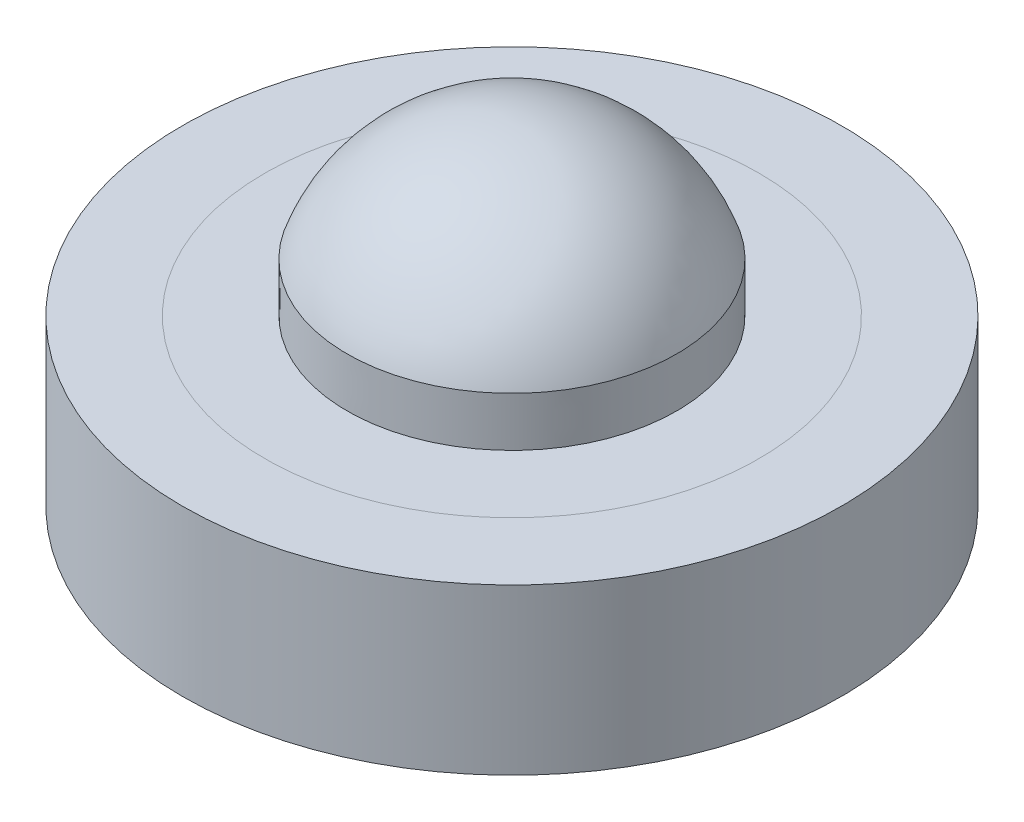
ISO-10303-21;
HEADER;
FILE_DESCRIPTION(('STEP AP214'),'2;1');
FILE_NAME('part.step','',(''),(''),'','','');
FILE_SCHEMA(('AUTOMOTIVE_DESIGN { 1 0 10303 214 1 1 1 1 }'));
ENDSEC;
DATA;
#1=APPLICATION_CONTEXT('core data for automotive mechanical design processes');
#2=APPLICATION_PROTOCOL_DEFINITION('international standard','automotive_design',2000,#1);
#3=PRODUCT_CONTEXT('',#1,'mechanical');
#4=PRODUCT('Part','Part','',(#3));
#5=PRODUCT_RELATED_PRODUCT_CATEGORY('part','',(#4));
#6=PRODUCT_DEFINITION_FORMATION('','',#4);
#7=PRODUCT_DEFINITION_CONTEXT('part definition',#1,'design');
#8=PRODUCT_DEFINITION('design','',#6,#7);
#9=PRODUCT_DEFINITION_SHAPE('','',#8);
#10=(LENGTH_UNIT() NAMED_UNIT(*) SI_UNIT(.MILLI.,.METRE.));
#11=(NAMED_UNIT(*) PLANE_ANGLE_UNIT() SI_UNIT($,.RADIAN.));
#12=(NAMED_UNIT(*) SI_UNIT($,.STERADIAN.) SOLID_ANGLE_UNIT());
#13=UNCERTAINTY_MEASURE_WITH_UNIT(LENGTH_MEASURE(1.E-05),#10,'distance_accuracy_value','');
#14=(GEOMETRIC_REPRESENTATION_CONTEXT(3) GLOBAL_UNCERTAINTY_ASSIGNED_CONTEXT((#13)) GLOBAL_UNIT_ASSIGNED_CONTEXT((#10,
#11,#12)) REPRESENTATION_CONTEXT('',''));
#15=CARTESIAN_POINT('',(0.,0.,0.));
#16=DIRECTION('',(0.,0.,1.));
#17=DIRECTION('',(1.,0.,0.));
#18=AXIS2_PLACEMENT_3D('',#15,#16,#17);
#19=CARTESIAN_POINT('',(4.8278025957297,-44.4320712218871,0.));
#20=DIRECTION('',(0.,1.,0.));
#21=DIRECTION('',(0.,0.,1.));
#22=AXIS2_PLACEMENT_3D('',#19,#20,#21);
#23=PLANE('',#22);
#24=CARTESIAN_POINT('',(4.8278025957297,-44.4320712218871,0.));
#25=DIRECTION('',(0.,1.,0.));
#26=DIRECTION('',(0.,0.,1.));
#27=AXIS2_PLACEMENT_3D('',#24,#25,#26);
#28=CIRCLE('',#27,20.);
#29=CARTESIAN_POINT('',(4.8278025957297,-44.4320712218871,20.));
#30=VERTEX_POINT('',#29);
#31=EDGE_CURVE('E105',#30,#30,#28,.T.);
#32=ORIENTED_EDGE('',*,*,#31,.F.);
#33=EDGE_LOOP('',(#32));
#34=FACE_BOUND('',#33,.T.);
#35=ADVANCED_FACE('F68',(#34),#23,.F.);
#36=CARTESIAN_POINT('',(4.8278025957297,-44.4320712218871,0.));
#37=DIRECTION('',(0.,1.,0.));
#38=DIRECTION('',(0.,0.,1.));
#39=AXIS2_PLACEMENT_3D('',#36,#37,#38);
#40=CYLINDRICAL_SURFACE('',#39,20.);
#41=ORIENTED_EDGE('',*,*,#31,.T.);
#42=EDGE_LOOP('',(#41));
#43=FACE_BOUND('',#42,.T.);
#44=CARTESIAN_POINT('',(4.8278025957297,-34.4320712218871,0.));
#45=DIRECTION('',(0.,1.,0.));
#46=DIRECTION('',(0.,0.,1.));
#47=AXIS2_PLACEMENT_3D('',#44,#45,#46);
#48=CIRCLE('',#47,20.);
#49=CARTESIAN_POINT('',(4.8278025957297,-34.4320712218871,20.));
#50=VERTEX_POINT('',#49);
#51=EDGE_CURVE('E72',#50,#50,#48,.F.);
#52=ORIENTED_EDGE('',*,*,#51,.T.);
#53=EDGE_LOOP('',(#52));
#54=FACE_BOUND('',#53,.T.);
#55=ADVANCED_FACE('F70',(#43,#54),#40,.T.);
#56=CARTESIAN_POINT('',(4.8278025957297,-34.8820712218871,0.));
#57=DIRECTION('',(0.,-1.,0.));
#58=DIRECTION('',(-1.,0.,0.));
#59=AXIS2_PLACEMENT_3D('',#56,#57,#58);
#60=SPHERICAL_SURFACE('',#59,10.58);
#61=CARTESIAN_POINT('',(4.8278025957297,-31.4320712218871,0.));
#62=DIRECTION('',(0.,-1.,0.));
#63=DIRECTION('',(0.,0.,-1.));
#64=AXIS2_PLACEMENT_3D('',#61,#62,#63);
#65=CIRCLE('',#64,10.0016948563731);
#66=CARTESIAN_POINT('',(4.8278025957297,-31.4320712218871,-10.0016948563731));
#67=VERTEX_POINT('',#66);
#68=EDGE_CURVE('E107',#67,#67,#65,.T.);
#69=ORIENTED_EDGE('',*,*,#68,.F.);
#70=EDGE_LOOP('',(#69));
#71=FACE_BOUND('',#70,.T.);
#72=ADVANCED_FACE('F101',(#71),#60,.T.);
#73=CARTESIAN_POINT('',(4.8278025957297,-31.4320712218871,0.));
#74=DIRECTION('',(0.,1.,0.));
#75=DIRECTION('',(0.,0.,1.));
#76=AXIS2_PLACEMENT_3D('',#73,#74,#75);
#77=CONICAL_SURFACE('',#76,10.0016948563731,0.000564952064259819);
#78=CARTESIAN_POINT('',(4.8278025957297,-34.4320712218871,0.));
#79=DIRECTION('',(0.,-1.,0.));
#80=DIRECTION('',(0.,0.,-1.));
#81=AXIS2_PLACEMENT_3D('',#78,#79,#80);
#82=CIRCLE('',#81,10.);
#83=CARTESIAN_POINT('',(4.8278025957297,-34.4320712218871,-10.));
#84=VERTEX_POINT('',#83);
#85=EDGE_CURVE('E77',#84,#84,#82,.T.);
#86=ORIENTED_EDGE('',*,*,#85,.F.);
#87=EDGE_LOOP('',(#86));
#88=FACE_BOUND('',#87,.T.);
#89=ORIENTED_EDGE('',*,*,#68,.T.);
#90=EDGE_LOOP('',(#89));
#91=FACE_BOUND('',#90,.T.);
#92=ADVANCED_FACE('F92',(#88,#91),#77,.T.);
#93=CARTESIAN_POINT('',(14.8278025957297,-34.4320712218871,0.));
#94=DIRECTION('',(0.,-1.,0.));
#95=DIRECTION('',(0.,0.,-1.));
#96=AXIS2_PLACEMENT_3D('',#93,#94,#95);
#97=PLANE('',#96);
#98=CARTESIAN_POINT('',(4.8278025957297,-34.4320712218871,-15.));
#99=CARTESIAN_POINT('',(5.07532465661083,-34.4320712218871,-15.0000190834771));
#100=CARTESIAN_POINT('',(5.32285951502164,-34.4320712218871,-14.9941059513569));
#101=CARTESIAN_POINT('',(5.81556402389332,-34.4320712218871,-14.9702985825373));
#102=CARTESIAN_POINT('',(6.06073787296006,-34.4320712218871,-14.9524909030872));
#103=CARTESIAN_POINT('',(6.54872354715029,-34.4320712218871,-14.9048990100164));
#104=CARTESIAN_POINT('',(6.79154106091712,-34.4320712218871,-14.8751733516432));
#105=CARTESIAN_POINT('',(7.27481111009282,-34.4320712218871,-14.8037804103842));
#106=CARTESIAN_POINT('',(7.51526796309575,-34.4320712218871,-14.7621423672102));
#107=CARTESIAN_POINT('',(7.99381910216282,-34.4320712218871,-14.6669527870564));
#108=CARTESIAN_POINT('',(8.23191332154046,-34.4320712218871,-14.6134009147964));
#109=CARTESIAN_POINT('',(8.70574394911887,-34.4320712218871,-14.4944140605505));
#110=CARTESIAN_POINT('',(8.94147298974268,-34.4320712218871,-14.4289497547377));
#111=CARTESIAN_POINT('',(9.41058131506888,-34.4320712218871,-14.286166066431));
#112=CARTESIAN_POINT('',(9.64394327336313,-34.4320712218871,-14.2087897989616));
#113=CARTESIAN_POINT('',(10.1083271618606,-34.4320712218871,-14.042212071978));
#114=CARTESIAN_POINT('',(10.3393195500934,-34.4320712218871,-13.9529283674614));
#115=CARTESIAN_POINT('',(10.7967237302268,-34.4320712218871,-13.7634844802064));
#116=CARTESIAN_POINT('',(11.0231368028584,-34.4320712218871,-13.6633273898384));
#117=CARTESIAN_POINT('',(11.4691967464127,-34.4320712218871,-13.4528238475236));
#118=CARTESIAN_POINT('',(11.6888805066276,-34.4320712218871,-13.3425556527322));
#119=CARTESIAN_POINT('',(12.121487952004,-34.4320712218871,-13.1118590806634));
#120=CARTESIAN_POINT('',(12.3344391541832,-34.4320712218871,-12.9914823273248));
#121=CARTESIAN_POINT('',(12.7535917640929,-34.4320712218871,-12.7405951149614));
#122=CARTESIAN_POINT('',(12.9598081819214,-34.4320712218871,-12.6101097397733));
#123=CARTESIAN_POINT('',(13.3655043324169,-34.4320712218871,-12.3390321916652));
#124=CARTESIAN_POINT('',(13.5649836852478,-34.4320712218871,-12.1984394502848));
#125=CARTESIAN_POINT('',(13.9572217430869,-34.4320712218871,-11.90717295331));
#126=CARTESIAN_POINT('',(14.1499622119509,-34.4320712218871,-11.7564746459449));
#127=CARTESIAN_POINT('',(14.5287406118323,-34.4320712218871,-11.4450198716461));
#128=CARTESIAN_POINT('',(14.7147405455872,-34.4320712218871,-11.2842172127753));
#129=CARTESIAN_POINT('',(15.0800586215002,-34.4320712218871,-10.9525778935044));
#130=CARTESIAN_POINT('',(15.2593177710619,-34.4320712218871,-10.7816763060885));
#131=CARTESIAN_POINT('',(15.6094238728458,-34.4320712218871,-10.4315941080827));
#132=CARTESIAN_POINT('',(15.7802740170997,-34.4320712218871,-10.2524166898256));
#133=CARTESIAN_POINT('',(16.1118235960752,-34.4320712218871,-9.88723717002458));
#134=CARTESIAN_POINT('',(16.2725870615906,-34.4320712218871,-9.70129325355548));
#135=CARTESIAN_POINT('',(16.5839804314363,-34.4320712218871,-9.32260567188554));
#136=CARTESIAN_POINT('',(16.7346555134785,-34.4320712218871,-9.12989917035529));
#137=CARTESIAN_POINT('',(17.0258916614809,-34.4320712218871,-8.73770686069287));
#138=CARTESIAN_POINT('',(17.1664761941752,-34.4320712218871,-8.53823848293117));
#139=CARTESIAN_POINT('',(17.4375536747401,-34.4320712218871,-8.13254228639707));
#140=CARTESIAN_POINT('',(17.5680460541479,-34.4320712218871,-7.92631408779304));
#141=CARTESIAN_POINT('',(17.8189639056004,-34.4320712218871,-7.50711592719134));
#142=CARTESIAN_POINT('',(17.9393631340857,-34.4320712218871,-7.29413026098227));
#143=CARTESIAN_POINT('',(18.1701201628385,-34.4320712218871,-6.86143135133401));
#144=CARTESIAN_POINT('',(18.2804251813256,-34.4320712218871,-6.64168997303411));
#145=CARTESIAN_POINT('',(18.4910222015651,-34.4320712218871,-6.19549401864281));
#146=CARTESIAN_POINT('',(18.5912348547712,-34.4320712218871,-5.96900203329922));
#147=CARTESIAN_POINT('',(18.7807200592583,-34.4320712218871,-5.51158845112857));
#148=CARTESIAN_POINT('',(18.869996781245,-34.4320712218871,-5.28066858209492));
#149=CARTESIAN_POINT('',(19.0365604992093,-34.4320712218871,-4.81640816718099));
#150=CARTESIAN_POINT('',(19.113928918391,-34.4320712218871,-4.58309687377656));
#151=CARTESIAN_POINT('',(19.2567014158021,-34.4320712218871,-4.11407008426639));
#152=CARTESIAN_POINT('',(19.3221614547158,-34.4320712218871,-3.87837163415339));
#153=CARTESIAN_POINT('',(19.4411430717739,-34.4320712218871,-3.40458193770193));
#154=CARTESIAN_POINT('',(19.4946930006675,-34.4320712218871,-3.16649781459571));
#155=CARTESIAN_POINT('',(19.589882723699,-34.4320712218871,-2.68794654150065));
#156=CARTESIAN_POINT('',(19.6315218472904,-34.4320712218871,-2.44747925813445));
#157=CARTESIAN_POINT('',(19.7029195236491,-34.4320712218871,-1.9641685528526));
#158=CARTESIAN_POINT('',(19.7326478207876,-34.4320712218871,-1.72132066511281));
#159=CARTESIAN_POINT('',(19.7802528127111,-34.4320712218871,-1.23325210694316));
#160=CARTESIAN_POINT('',(19.7980699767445,-34.4320712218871,-0.988025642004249));
#161=CARTESIAN_POINT('',(19.8218844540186,-34.4320712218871,-0.495202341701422));
#162=CARTESIAN_POINT('',(19.8277941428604,-34.4320712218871,-0.247601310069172));
#163=CARTESIAN_POINT('',(19.8278110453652,-34.4320712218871,0.247506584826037));
#164=CARTESIAN_POINT('',(19.8219227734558,-34.4320712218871,0.495013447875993));
#165=CARTESIAN_POINT('',(19.7981428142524,-34.4320712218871,0.98767531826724));
#166=CARTESIAN_POINT('',(19.7803375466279,-34.4320712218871,1.23283445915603));
#167=CARTESIAN_POINT('',(19.7327533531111,-34.4320712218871,1.72079537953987));
#168=CARTESIAN_POINT('',(19.7030326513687,-34.4320712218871,1.96360282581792));
#169=CARTESIAN_POINT('',(19.6316458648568,-34.4320712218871,2.44685972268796));
#170=CARTESIAN_POINT('',(19.5900086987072,-34.4320712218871,2.68731344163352));
#171=CARTESIAN_POINT('',(19.4948188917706,-34.4320712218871,3.16586469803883));
#172=CARTESIAN_POINT('',(19.4412655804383,-34.4320712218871,3.40396210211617));
#173=CARTESIAN_POINT('',(19.3222734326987,-34.4320712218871,3.87780567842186));
#174=CARTESIAN_POINT('',(19.2568049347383,-34.4320712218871,4.11354439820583));
#175=CARTESIAN_POINT('',(19.1140104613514,-34.4320712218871,4.58267859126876));
#176=CARTESIAN_POINT('',(19.0366272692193,-34.4320712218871,4.81605663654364));
#177=CARTESIAN_POINT('',(18.8700336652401,-34.4320712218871,5.28047940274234));
#178=CARTESIAN_POINT('',(18.7807406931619,-34.4320712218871,5.51149446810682));
#179=CARTESIAN_POINT('',(18.5912867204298,-34.4320712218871,5.96892098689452));
#180=CARTESIAN_POINT('',(18.4911298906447,-34.4320712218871,6.19533416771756));
#181=CARTESIAN_POINT('',(18.2806265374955,-34.4320712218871,6.64139418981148));
#182=CARTESIAN_POINT('',(18.1703582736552,-34.4320712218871,6.86107792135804));
#183=CARTESIAN_POINT('',(17.9396616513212,-34.4320712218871,7.29368534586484));
#184=CARTESIAN_POINT('',(17.8192849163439,-34.4320712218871,7.50663655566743));
#185=CARTESIAN_POINT('',(17.5683977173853,-34.4320712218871,7.92578917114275));
#186=CARTESIAN_POINT('',(17.4379123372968,-34.4320712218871,8.13200558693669));
#187=CARTESIAN_POINT('',(17.1668347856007,-34.4320712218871,8.53770173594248));
#188=CARTESIAN_POINT('',(17.026242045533,-34.4320712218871,8.7371810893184));
#189=CARTESIAN_POINT('',(16.7349755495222,-34.4320712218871,9.12941914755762));
#190=CARTESIAN_POINT('',(16.5842772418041,-34.4320712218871,9.32215961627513));
#191=CARTESIAN_POINT('',(16.2728224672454,-34.4320712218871,9.70093801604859));
#192=CARTESIAN_POINT('',(16.1120198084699,-34.4320712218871,9.88693794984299));
#193=CARTESIAN_POINT('',(15.7803804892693,-34.4320712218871,10.2522560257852));
#194=CARTESIAN_POINT('',(15.6094789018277,-34.4320712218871,10.4315151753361));
#195=CARTESIAN_POINT('',(15.2593967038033,-34.4320712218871,10.7816212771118));
#196=CARTESIAN_POINT('',(15.0802192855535,-34.4320712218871,10.9524714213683));
#197=CARTESIAN_POINT('',(14.7150397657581,-34.4320712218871,11.2840210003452));
#198=CARTESIAN_POINT('',(14.5290958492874,-34.4320712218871,11.4447844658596));
#199=CARTESIAN_POINT('',(14.1504082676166,-34.4320712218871,11.7561778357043));
#200=CARTESIAN_POINT('',(13.957701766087,-34.4320712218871,11.9068529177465));
#201=CARTESIAN_POINT('',(13.5655094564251,-34.4320712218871,12.1980890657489));
#202=CARTESIAN_POINT('',(13.3660410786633,-34.4320712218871,12.3386735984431));
#203=CARTESIAN_POINT('',(12.9603448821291,-34.4320712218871,12.609751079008));
#204=CARTESIAN_POINT('',(12.7541166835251,-34.4320712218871,12.7402434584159));
#205=CARTESIAN_POINT('',(12.3349185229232,-34.4320712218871,12.9911613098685));
#206=CARTESIAN_POINT('',(12.121932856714,-34.4320712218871,13.111560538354));
#207=CARTESIAN_POINT('',(11.6892339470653,-34.4320712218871,13.3423175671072));
#208=CARTESIAN_POINT('',(11.4694925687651,-34.4320712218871,13.4526225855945));
#209=CARTESIAN_POINT('',(11.0232966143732,-34.4320712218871,13.6632196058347));
#210=CARTESIAN_POINT('',(10.7968046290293,-34.4320712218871,13.7634322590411));
#211=CARTESIAN_POINT('',(10.3393910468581,-34.4320712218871,13.9529174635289));
#212=CARTESIAN_POINT('',(10.1084711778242,-34.4320712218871,14.0421941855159));
#213=CARTESIAN_POINT('',(9.64421076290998,-34.4320712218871,14.2087579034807));
#214=CARTESIAN_POINT('',(9.41089946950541,-34.4320712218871,14.2861263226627));
#215=CARTESIAN_POINT('',(8.94187267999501,-34.4320712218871,14.4288988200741));
#216=CARTESIAN_POINT('',(8.70617422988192,-34.4320712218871,14.4943588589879));
#217=CARTESIAN_POINT('',(8.23238453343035,-34.4320712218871,14.6133404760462));
#218=CARTESIAN_POINT('',(7.9943004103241,-34.4320712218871,14.6668904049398));
#219=CARTESIAN_POINT('',(7.51574913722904,-34.4320712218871,14.7620801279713));
#220=CARTESIAN_POINT('',(7.27528185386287,-34.4320712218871,14.8037192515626));
#221=CARTESIAN_POINT('',(6.79197114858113,-34.4320712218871,14.8751169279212));
#222=CARTESIAN_POINT('',(6.54912326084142,-34.4320712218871,14.9048452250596));
#223=CARTESIAN_POINT('',(6.06105470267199,-34.4320712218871,14.9524502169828));
#224=CARTESIAN_POINT('',(5.81582823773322,-34.4320712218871,14.9702673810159));
#225=CARTESIAN_POINT('',(5.32300493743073,-34.4320712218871,14.9940818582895));
#226=CARTESIAN_POINT('',(5.07540390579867,-34.4320712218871,14.999991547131));
#227=CARTESIAN_POINT('',(4.58029601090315,-34.4320712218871,15.0000084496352));
#228=CARTESIAN_POINT('',(4.33278914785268,-34.4320712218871,14.9941201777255));
#229=CARTESIAN_POINT('',(3.84012727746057,-34.4320712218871,14.9703402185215));
#230=CARTESIAN_POINT('',(3.59496813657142,-34.4320712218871,14.9525349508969));
#231=CARTESIAN_POINT('',(3.10700721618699,-34.4320712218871,14.9049507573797));
#232=CARTESIAN_POINT('',(2.86419976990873,-34.4320712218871,14.8752300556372));
#233=CARTESIAN_POINT('',(2.3809428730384,-34.4320712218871,14.8038432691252));
#234=CARTESIAN_POINT('',(2.14048915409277,-34.4320712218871,14.7622061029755));
#235=CARTESIAN_POINT('',(1.66193789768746,-34.4320712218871,14.667016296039));
#236=CARTESIAN_POINT('',(1.42384049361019,-34.4320712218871,14.6134629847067));
#237=CARTESIAN_POINT('',(0.949996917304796,-34.4320712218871,14.4944708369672));
#238=CARTESIAN_POINT('',(0.714258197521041,-34.4320712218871,14.4290023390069));
#239=CARTESIAN_POINT('',(0.2451240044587,-34.4320712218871,14.2862078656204));
#240=CARTESIAN_POINT('',(0.0117459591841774,-34.4320712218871,14.2088246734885));
#241=CARTESIAN_POINT('',(-0.452676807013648,-34.4320712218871,14.0422310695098));
#242=CARTESIAN_POINT('',(-0.68369187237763,-34.4320712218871,13.9529380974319));
#243=CARTESIAN_POINT('',(-1.14111839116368,-34.4320712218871,13.7634841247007));
#244=CARTESIAN_POINT('',(-1.36753157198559,-34.4320712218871,13.6633272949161));
#245=CARTESIAN_POINT('',(-1.81359159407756,-34.4320712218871,13.4528239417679));
#246=CARTESIAN_POINT('',(-2.03327532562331,-34.4320712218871,13.342555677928));
#247=CARTESIAN_POINT('',(-2.46588275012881,-34.4320712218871,13.1118590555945));
#248=CARTESIAN_POINT('',(-2.67883395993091,-34.4320712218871,12.9914823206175));
#249=CARTESIAN_POINT('',(-3.09798657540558,-34.4320712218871,12.7405951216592));
#250=CARTESIAN_POINT('',(-3.30420299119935,-34.4320712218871,12.6101097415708));
#251=CARTESIAN_POINT('',(-3.70989914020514,-34.4320712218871,12.3390321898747));
#252=CARTESIAN_POINT('',(-3.90937849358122,-34.4320712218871,12.1984394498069));
#253=CARTESIAN_POINT('',(-4.30161655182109,-34.4320712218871,11.9071729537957));
#254=CARTESIAN_POINT('',(-4.49435702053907,-34.4320712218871,11.7564746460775));
#255=CARTESIAN_POINT('',(-4.87313542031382,-34.4320712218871,11.4450198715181));
#256=CARTESIAN_POINT('',(-5.05913535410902,-34.4320712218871,11.2842172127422));
#257=CARTESIAN_POINT('',(-5.42445343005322,-34.4320712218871,10.9525778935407));
#258=CARTESIAN_POINT('',(-5.6037125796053,-34.4320712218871,10.7816763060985));
#259=CARTESIAN_POINT('',(-5.9538186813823,-34.4320712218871,10.431594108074));
#260=CARTESIAN_POINT('',(-6.12466882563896,-34.4320712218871,10.2524166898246));
#261=CARTESIAN_POINT('',(-6.45621840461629,-34.4320712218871,9.88723717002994));
#262=CARTESIAN_POINT('',(-6.6169818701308,-34.4320712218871,9.70129325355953));
#263=CARTESIAN_POINT('',(-6.92837523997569,-34.4320712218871,9.32260567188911));
#264=CARTESIAN_POINT('',(-7.079050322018,-34.4320712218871,9.12989917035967));
#265=CARTESIAN_POINT('',(-7.37028647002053,-34.4320712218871,8.73770686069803));
#266=CARTESIAN_POINT('',(-7.51087100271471,-34.4320712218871,8.5382384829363));
#267=CARTESIAN_POINT('',(-7.7819484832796,-34.4320712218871,8.13254228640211));
#268=CARTESIAN_POINT('',(-7.91244086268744,-34.4320712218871,7.926314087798));
#269=CARTESIAN_POINT('',(-8.16335871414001,-34.4320712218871,7.5071159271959));
#270=CARTESIAN_POINT('',(-8.28375794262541,-34.4320712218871,7.29413026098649));
#271=CARTESIAN_POINT('',(-8.51451497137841,-34.4320712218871,6.86143135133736));
#272=CARTESIAN_POINT('',(-8.62481998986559,-34.4320712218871,6.64168997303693));
#273=CARTESIAN_POINT('',(-8.83541701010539,-34.4320712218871,6.19549401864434));
#274=CARTESIAN_POINT('',(-8.93562966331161,-34.4320712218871,5.96900203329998));
#275=CARTESIAN_POINT('',(-9.12511486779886,-34.4320712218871,5.51158845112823));
#276=CARTESIAN_POINT('',(-9.21439158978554,-34.4320712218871,5.28066858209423));
#277=CARTESIAN_POINT('',(-9.3809553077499,-34.4320712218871,4.81640816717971));
#278=CARTESIAN_POINT('',(-9.45832372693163,-34.4320712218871,4.58309687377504));
#279=CARTESIAN_POINT('',(-9.6010962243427,-34.4320712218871,4.11407008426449));
#280=CARTESIAN_POINT('',(-9.66655626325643,-34.4320712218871,3.87837163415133));
#281=CARTESIAN_POINT('',(-9.78553788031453,-34.4320712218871,3.40458193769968));
#282=CARTESIAN_POINT('',(-9.83908780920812,-34.4320712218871,3.16649781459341));
#283=CARTESIAN_POINT('',(-9.93427753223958,-34.4320712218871,2.68794654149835));
#284=CARTESIAN_POINT('',(-9.97591665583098,-34.4320712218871,2.4474792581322));
#285=CARTESIAN_POINT('',(-10.0473143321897,-34.4320712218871,1.96416855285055));
#286=CARTESIAN_POINT('',(-10.0770426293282,-34.4320712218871,1.72132066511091));
#287=CARTESIAN_POINT('',(-10.1246476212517,-34.4320712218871,1.23325210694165));
#288=CARTESIAN_POINT('',(-10.1424647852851,-34.4320712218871,0.988025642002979));
#289=CARTESIAN_POINT('',(-10.1662792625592,-34.4320712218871,0.495202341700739));
#290=CARTESIAN_POINT('',(-10.172188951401,-34.4320712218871,0.247601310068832));
#291=CARTESIAN_POINT('',(-10.1722058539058,-34.4320712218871,-0.247506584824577));
#292=CARTESIAN_POINT('',(-10.1663175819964,-34.4320712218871,-0.495013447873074));
#293=CARTESIAN_POINT('',(-10.142537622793,-34.4320712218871,-0.987675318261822));
#294=CARTESIAN_POINT('',(-10.1247323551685,-34.4320712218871,-1.23283445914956));
#295=CARTESIAN_POINT('',(-10.0771481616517,-34.4320712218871,-1.72079537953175));
#296=CARTESIAN_POINT('',(-10.0474274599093,-34.4320712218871,-1.96360282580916));
#297=CARTESIAN_POINT('',(-9.97604067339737,-34.4320712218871,-2.44685972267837));
#298=CARTESIAN_POINT('',(-9.93440350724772,-34.4320712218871,-2.68731344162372));
#299=CARTESIAN_POINT('',(-9.83921370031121,-34.4320712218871,-3.16586469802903));
#300=CARTESIAN_POINT('',(-9.78566038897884,-34.4320712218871,-3.40396210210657));
#301=CARTESIAN_POINT('',(-9.66666824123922,-34.4320712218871,-3.87780567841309));
#302=CARTESIAN_POINT('',(-9.6011997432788,-34.4320712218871,-4.11354439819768));
#303=CARTESIAN_POINT('',(-9.45840526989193,-34.4320712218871,-4.58267859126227));
#304=CARTESIAN_POINT('',(-9.38102207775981,-34.4320712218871,-4.81605663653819));
#305=CARTESIAN_POINT('',(-9.21442847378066,-34.4320712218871,-5.2804794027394));
#306=CARTESIAN_POINT('',(-9.12513550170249,-34.4320712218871,-5.51149446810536));
#307=CARTESIAN_POINT('',(-8.93568152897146,-34.4320712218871,-5.96892098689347));
#308=CARTESIAN_POINT('',(-8.83552469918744,-34.4320712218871,-6.19533416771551));
#309=CARTESIAN_POINT('',(-8.62502134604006,-34.4320712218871,-6.64139418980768));
#310=CARTESIAN_POINT('',(-8.51475308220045,-34.4320712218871,-6.8610779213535));
#311=CARTESIAN_POINT('',(-8.28405645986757,-34.4320712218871,-7.29368534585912));
#312=CARTESIAN_POINT('',(-8.16367972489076,-34.4320712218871,-7.50663655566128));
#313=CARTESIAN_POINT('',(-7.91279252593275,-34.4320712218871,-7.92578917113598));
#314=CARTESIAN_POINT('',(-7.78230714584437,-34.4320712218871,-8.13200558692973));
#315=CARTESIAN_POINT('',(-7.51122959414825,-34.4320712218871,-8.53770173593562));
#316=CARTESIAN_POINT('',(-7.37063685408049,-34.4320712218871,-8.73718108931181));
#317=CARTESIAN_POINT('',(-7.07937035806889,-34.4320712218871,-9.12941914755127));
#318=CARTESIAN_POINT('',(-6.92867205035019,-34.4320712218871,-9.32215961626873));
#319=CARTESIAN_POINT('',(-6.61721727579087,-34.4320712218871,-9.7009380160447));
#320=CARTESIAN_POINT('',(-6.4564146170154,-34.4320712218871,-9.88693794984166));
#321=CARTESIAN_POINT('',(-6.12477529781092,-34.4320712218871,-10.2522560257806));
#322=CARTESIAN_POINT('',(-5.95387371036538,-34.4320712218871,-10.4315151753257));
#323=CARTESIAN_POINT('',(-5.60379151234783,-34.4320712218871,-10.7816212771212));
#324=CARTESIAN_POINT('',(-5.4246140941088,-34.4320712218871,-10.9524714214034));
#325=CARTESIAN_POINT('',(-5.05943457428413,-34.4320712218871,-11.2840210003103));
#326=CARTESIAN_POINT('',(-4.87349065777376,-34.4320712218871,-11.4447844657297));
#327=CARTESIAN_POINT('',(-4.49480307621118,-34.4320712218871,-11.7561778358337));
#328=CARTESIAN_POINT('',(-4.30209657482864,-34.4320712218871,-11.9068529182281));
#329=CARTESIAN_POINT('',(-3.9099042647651,-34.4320712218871,-12.1980890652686));
#330=CARTESIAN_POINT('',(-3.71043588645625,-34.4320712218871,-12.3386735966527));
#331=CARTESIAN_POINT('',(-3.30473969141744,-34.4320712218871,-12.6097510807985));
#332=CARTESIAN_POINT('',(-3.09851149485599,-34.4320712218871,-12.7402434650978));
#333=CARTESIAN_POINT('',(-2.67931332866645,-34.4320712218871,-12.9911613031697));
#334=CARTESIAN_POINT('',(-2.46632765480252,-34.4320712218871,-13.1115605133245));
#335=CARTESIAN_POINT('',(-2.0336287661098,-34.4320712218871,-13.3423175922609));
#336=CARTESIAN_POINT('',(-1.81388741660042,-34.4320712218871,-13.4526226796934));
#337=CARTESIAN_POINT('',(-1.36769138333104,-34.4320712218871,-13.6632195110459));
#338=CARTESIAN_POINT('',(-1.14119928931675,-34.4320712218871,-13.7634319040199));
#339=CARTESIAN_POINT('',(-0.683763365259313,-34.4320712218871,-13.9529271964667));
#340=CARTESIAN_POINT('',(-0.452820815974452,-34.4320712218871,-14.0422131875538));
#341=CARTESIAN_POINT('',(0.0114784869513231,-34.4320712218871,-14.2087927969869));
#342=CARTESIAN_POINT('',(0.244805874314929,-34.4320712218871,-14.2861681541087));
#343=CARTESIAN_POINT('',(0.713858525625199,-34.4320712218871,-14.4289514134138));
#344=CARTESIAN_POINT('',(0.949566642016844,-34.4320712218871,-14.4944156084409));
#345=CARTESIAN_POINT('',(1.42336932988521,-34.4320712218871,-14.6134026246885));
#346=CARTESIAN_POINT('',(1.66145669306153,-34.4320712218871,-14.6669541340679));
#347=CARTESIAN_POINT('',(2.14000793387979,-34.4320712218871,-14.7621436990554));
#348=CARTESIAN_POINT('',(2.38047187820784,-34.4320712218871,-14.8037814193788));
#349=CARTESIAN_POINT('',(2.86376998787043,-34.4320712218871,-14.875174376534));
#350=CARTESIAN_POINT('',(3.10660857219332,-34.4320712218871,-14.9048996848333));
#351=CARTESIAN_POINT('',(3.59465027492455,-34.4320712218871,-14.9524915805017));
#352=CARTESIAN_POINT('',(3.83985914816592,-34.4320712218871,-14.9702989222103));
#353=CARTESIAN_POINT('',(4.33264769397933,-34.4320712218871,-14.9941062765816));
#354=CARTESIAN_POINT('',(4.58023159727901,-34.4320712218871,-15.0000190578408));
#355=CARTESIAN_POINT('',(4.8278025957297,-34.4320712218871,-15.));
#356=B_SPLINE_CURVE_WITH_KNOTS('',3,(#98,#99,#100,#101,#102,#103,#104,#105,#106,#107,#108,#109,
#110,#111,#112,#113,#114,#115,#116,#117,#118,#119,#120,#121,#122,#123,#124,#125,#126,#127,#128,
#129,#130,#131,#132,#133,#134,#135,#136,#137,#138,#139,#140,#141,#142,#143,#144,#145,#146,#147,
#148,#149,#150,#151,#152,#153,#154,#155,#156,#157,#158,#159,#160,#161,#162,#163,#164,#165,#166,
#167,#168,#169,#170,#171,#172,#173,#174,#175,#176,#177,#178,#179,#180,#181,#182,#183,#184,#185,
#186,#187,#188,#189,#190,#191,#192,#193,#194,#195,#196,#197,#198,#199,#200,#201,#202,#203,#204,
#205,#206,#207,#208,#209,#210,#211,#212,#213,#214,#215,#216,#217,#218,#219,#220,#221,#222,#223,
#224,#225,#226,#227,#228,#229,#230,#231,#232,#233,#234,#235,#236,#237,#238,#239,#240,#241,#242,
#243,#244,#245,#246,#247,#248,#249,#250,#251,#252,#253,#254,#255,#256,#257,#258,#259,#260,#261,
#262,#263,#264,#265,#266,#267,#268,#269,#270,#271,#272,#273,#274,#275,#276,#277,#278,#279,#280,
#281,#282,#283,#284,#285,#286,#287,#288,#289,#290,#291,#292,#293,#294,#295,#296,#297,#298,#299,
#300,#301,#302,#303,#304,#305,#306,#307,#308,#309,#310,#311,#312,#313,#314,#315,#316,#317,#318,
#319,#320,#321,#322,#323,#324,#325,#326,#327,#328,#329,#330,#331,#332,#333,#334,#335,#336,#337,
#338,#339,#340,#341,#342,#343,#344,#345,#346,#347,#348,#349,#350,#351,#352,#353,#354,#355),
.UNSPECIFIED.,.F.,.F.,(4,2,2,2,2,2,2,2,2,2,2,2,2,2,2,2,2,2,2,2,2,2,2,2,2,2,2,2,2,2,2,2,2,2,2,2,
2,2,2,2,2,2,2,2,2,2,2,2,2,2,2,2,2,2,2,2,2,2,2,2,2,2,2,2,2,2,2,2,2,2,2,2,2,2,2,2,2,2,2,2,2,2,2,2,
2,2,2,2,2,2,2,2,2,2,2,2,2,2,2,2,2,2,2,2,2,2,2,2,2,2,2,2,2,2,2,2,2,2,2,2,2,2,2,2,2,2,2,2,4),(0.,
0.742513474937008,1.47968166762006,2.21327155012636,2.94507601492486,3.67690107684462,
4.4105525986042,5.14782302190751,5.8904785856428,6.63292349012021,7.37004184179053,
8.10360136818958,8.8353955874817,9.56723099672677,10.3009137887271,11.038236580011,
11.7809656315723,12.5234105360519,13.2605288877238,13.9940884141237,14.7258826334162,
15.4577180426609,16.1914008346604,16.9287236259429,17.6714526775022,18.4138975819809,
19.1510159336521,19.8845754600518,20.6163696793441,21.3482050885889,22.0818878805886,
22.8192106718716,23.5619397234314,24.3043846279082,25.0415029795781,25.7750625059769,
26.5068567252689,27.2386921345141,27.9723749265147,28.7096977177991,29.4524267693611,
30.1948716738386,30.931990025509,31.6655495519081,32.3973437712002,33.1291791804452,
33.8628619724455,34.6001847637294,35.3429138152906,36.0853587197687,36.8224770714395,
37.5560365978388,38.287830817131,39.019666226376,39.753349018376,40.4906718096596,
41.2334008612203,41.9758457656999,42.7129641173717,43.4465236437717,44.1783178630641,
44.9101532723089,45.6438360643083,46.3811588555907,47.1238879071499,47.8663328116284,
48.6034511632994,49.3370106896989,50.0688049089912,50.8006403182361,51.5343231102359,
52.2716459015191,53.0143749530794,53.7568198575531,54.4939382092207,55.2274977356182,
55.9592919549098,56.6911273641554,57.4248101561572,58.1621329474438,58.9048619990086,
59.6473069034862,60.3844252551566,61.1179847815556,61.8497790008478,62.5816144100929,
63.3152972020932,64.0526199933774,64.795349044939,65.5377939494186,66.2749123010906,
67.0084718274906,67.7402660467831,68.4721014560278,69.205784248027,69.9431070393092,
70.685836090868,71.4282809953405,72.1653993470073,72.8989588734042,73.6307530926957,
74.3625885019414,75.0962712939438,75.8335940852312,76.5763231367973,77.3187680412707,
78.0558863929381,78.7894459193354,79.5212401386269,80.2530755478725,80.9867583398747,
81.7240811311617,82.4668101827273,83.2092550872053,83.9463734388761,84.6799329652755,
85.4117271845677,86.1435625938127,86.8772453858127,87.6145681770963,88.357297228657,
89.0998156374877,89.8369863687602,90.5705771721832,91.3023817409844,92.0342069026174,
92.7678593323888,93.5051322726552,94.2477927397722),.UNSPECIFIED.);
#357=CARTESIAN_POINT('',(4.8278025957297,-34.4320712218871,-15.));
#358=VERTEX_POINT('',#357);
#359=EDGE_CURVE('E13',#358,#358,#356,.T.);
#360=ORIENTED_EDGE('',*,*,#359,.F.);
#361=EDGE_LOOP('',(#360));
#362=FACE_BOUND('',#361,.T.);
#363=ORIENTED_EDGE('',*,*,#85,.T.);
#364=EDGE_LOOP('',(#363));
#365=FACE_BOUND('',#364,.T.);
#366=ADVANCED_FACE('F81',(#362,#365),#97,.F.);
#367=CARTESIAN_POINT('',(4.51562772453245,-34.4320712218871,-15.0000002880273));
#368=DIRECTION('',(0.,1.,0.));
#369=DIRECTION('',(0.999999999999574,0.,9.22647382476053E-07));
#370=AXIS2_PLACEMENT_3D('',#367,#368,#369);
#371=PLANE('',#370);
#372=ORIENTED_EDGE('',*,*,#51,.F.);
#373=EDGE_LOOP('',(#372));
#374=FACE_BOUND('',#373,.T.);
#375=ORIENTED_EDGE('',*,*,#359,.T.);
#376=EDGE_LOOP('',(#375));
#377=FACE_BOUND('',#376,.T.);
#378=ADVANCED_FACE('F84',(#374,#377),#371,.T.);
#379=CLOSED_SHELL('',(#35,#55,#72,#92,#366,#378));
#380=MANIFOLD_SOLID_BREP('B2',#379);
#381=ADVANCED_BREP_SHAPE_REPRESENTATION('',(#18,#380),#14);
#382=SHAPE_DEFINITION_REPRESENTATION(#9,#381);
ENDSEC;
END-ISO-10303-21;
